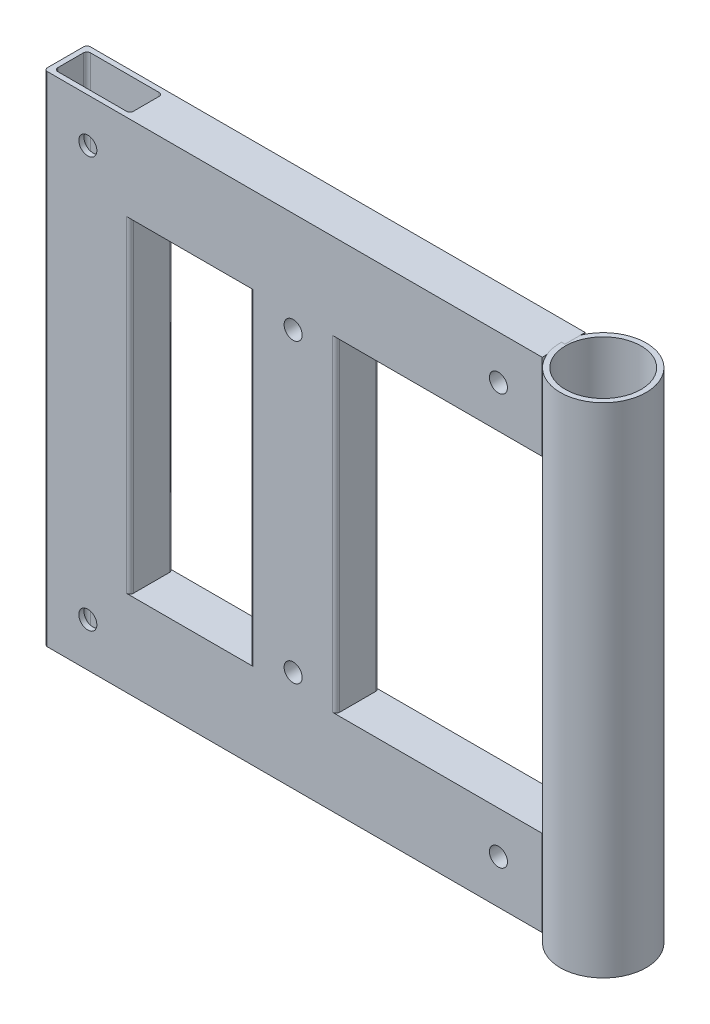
ISO-10303-21;
HEADER;
FILE_DESCRIPTION(('STEP AP214'),'2;1');
FILE_NAME('part.step','',(''),(''),'','','');
FILE_SCHEMA(('AUTOMOTIVE_DESIGN { 1 0 10303 214 1 1 1 1 }'));
ENDSEC;
DATA;
#1=APPLICATION_CONTEXT('core data for automotive mechanical design processes');
#2=APPLICATION_PROTOCOL_DEFINITION('international standard','automotive_design',2000,#1);
#3=PRODUCT_CONTEXT('',#1,'mechanical');
#4=PRODUCT('Part','Part','',(#3));
#5=PRODUCT_RELATED_PRODUCT_CATEGORY('part','',(#4));
#6=PRODUCT_DEFINITION_FORMATION('','',#4);
#7=PRODUCT_DEFINITION_CONTEXT('part definition',#1,'design');
#8=PRODUCT_DEFINITION('design','',#6,#7);
#9=PRODUCT_DEFINITION_SHAPE('','',#8);
#10=(LENGTH_UNIT() NAMED_UNIT(*) SI_UNIT(.MILLI.,.METRE.));
#11=(NAMED_UNIT(*) PLANE_ANGLE_UNIT() SI_UNIT($,.RADIAN.));
#12=(NAMED_UNIT(*) SI_UNIT($,.STERADIAN.) SOLID_ANGLE_UNIT());
#13=UNCERTAINTY_MEASURE_WITH_UNIT(LENGTH_MEASURE(1.E-05),#10,'distance_accuracy_value','');
#14=(GEOMETRIC_REPRESENTATION_CONTEXT(3) GLOBAL_UNCERTAINTY_ASSIGNED_CONTEXT((#13)) GLOBAL_UNIT_ASSIGNED_CONTEXT((#10,
#11,#12)) REPRESENTATION_CONTEXT('',''));
#15=CARTESIAN_POINT('',(0.,0.,0.));
#16=DIRECTION('',(0.,0.,1.));
#17=DIRECTION('',(1.,0.,0.));
#18=AXIS2_PLACEMENT_3D('',#15,#16,#17);
#19=CARTESIAN_POINT('',(313.,-290.,12.5));
#20=DIRECTION('',(0.,1.,0.));
#21=DIRECTION('',(0.,0.,1.));
#22=AXIS2_PLACEMENT_3D('',#19,#20,#21);
#23=CYLINDRICAL_SURFACE('',#22,25.);
#24=CARTESIAN_POINT('',(313.,-290.,12.5));
#25=DIRECTION('',(0.,1.,0.));
#26=DIRECTION('',(0.,0.,1.));
#27=AXIS2_PLACEMENT_3D('',#24,#25,#26);
#28=CIRCLE('',#27,25.);
#29=CARTESIAN_POINT('',(313.,-290.,37.5));
#30=VERTEX_POINT('',#29);
#31=EDGE_CURVE('E11',#30,#30,#28,.T.);
#32=ORIENTED_EDGE('',*,*,#31,.T.);
#33=EDGE_LOOP('',(#32));
#34=FACE_BOUND('',#33,.T.);
#35=CARTESIAN_POINT('',(313.,0.,12.5));
#36=DIRECTION('',(0.,1.,0.));
#37=DIRECTION('',(0.,0.,1.));
#38=AXIS2_PLACEMENT_3D('',#35,#36,#37);
#39=CIRCLE('',#38,25.);
#40=CARTESIAN_POINT('',(313.,0.,37.5));
#41=VERTEX_POINT('',#40);
#42=EDGE_CURVE('E45',#41,#41,#39,.T.);
#43=ORIENTED_EDGE('',*,*,#42,.F.);
#44=EDGE_LOOP('',(#43));
#45=FACE_BOUND('',#44,.T.);
#46=ADVANCED_FACE('F42',(#34,#45),#23,.T.);
#47=CARTESIAN_POINT('',(313.,-290.,12.5));
#48=DIRECTION('',(0.,1.,0.));
#49=DIRECTION('',(0.,0.,1.));
#50=AXIS2_PLACEMENT_3D('',#47,#48,#49);
#51=PLANE('',#50);
#52=CARTESIAN_POINT('',(313.,-290.,12.5));
#53=DIRECTION('',(0.,1.,0.));
#54=DIRECTION('',(0.,0.,1.));
#55=AXIS2_PLACEMENT_3D('',#52,#53,#54);
#56=CIRCLE('',#55,21.9999999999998);
#57=CARTESIAN_POINT('',(313.,-290.,34.4999999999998));
#58=VERTEX_POINT('',#57);
#59=EDGE_CURVE('E55',#58,#58,#56,.T.);
#60=ORIENTED_EDGE('',*,*,#59,.T.);
#61=EDGE_LOOP('',(#60));
#62=FACE_BOUND('',#61,.T.);
#63=ORIENTED_EDGE('',*,*,#31,.F.);
#64=EDGE_LOOP('',(#63));
#65=FACE_BOUND('',#64,.T.);
#66=ADVANCED_FACE('F64',(#62,#65),#51,.F.);
#67=CARTESIAN_POINT('',(313.,0.,12.5));
#68=DIRECTION('',(0.,1.,0.));
#69=DIRECTION('',(0.,0.,1.));
#70=AXIS2_PLACEMENT_3D('',#67,#68,#69);
#71=PLANE('',#70);
#72=CARTESIAN_POINT('',(313.,0.,12.5));
#73=DIRECTION('',(0.,1.,0.));
#74=DIRECTION('',(0.,0.,1.));
#75=AXIS2_PLACEMENT_3D('',#72,#73,#74);
#76=CIRCLE('',#75,21.9999999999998);
#77=CARTESIAN_POINT('',(313.,0.,34.4999999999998));
#78=VERTEX_POINT('',#77);
#79=EDGE_CURVE('E57',#78,#78,#76,.T.);
#80=ORIENTED_EDGE('',*,*,#79,.F.);
#81=EDGE_LOOP('',(#80));
#82=FACE_BOUND('',#81,.T.);
#83=ORIENTED_EDGE('',*,*,#42,.T.);
#84=EDGE_LOOP('',(#83));
#85=FACE_BOUND('',#84,.T.);
#86=ADVANCED_FACE('F70',(#82,#85),#71,.T.);
#87=CARTESIAN_POINT('',(313.,-290.,12.5));
#88=DIRECTION('',(0.,1.,0.));
#89=DIRECTION('',(0.,0.,1.));
#90=AXIS2_PLACEMENT_3D('',#87,#88,#89);
#91=CYLINDRICAL_SURFACE('',#90,21.9999999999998);
#92=ORIENTED_EDGE('',*,*,#59,.F.);
#93=EDGE_LOOP('',(#92));
#94=FACE_BOUND('',#93,.T.);
#95=ORIENTED_EDGE('',*,*,#79,.T.);
#96=EDGE_LOOP('',(#95));
#97=FACE_BOUND('',#96,.T.);
#98=ADVANCED_FACE('F67',(#94,#97),#91,.F.);
#99=CLOSED_SHELL('',(#46,#66,#86,#98));
#100=MANIFOLD_SOLID_BREP('B2',#99);
#101=CARTESIAN_POINT('',(290.,0.,25.));
#102=DIRECTION('',(-1.,0.,0.));
#103=DIRECTION('',(0.,-1.,0.));
#104=AXIS2_PLACEMENT_3D('',#101,#102,#103);
#105=PLANE('',#104);
#106=DIRECTION('',(0.,1.,0.));
#107=VECTOR('',#106,1.);
#108=CARTESIAN_POINT('',(290.,0.,25.));
#109=LINE('',#108,#107);
#110=CARTESIAN_POINT('',(290.,-50.,25.));
#111=VERTEX_POINT('',#110);
#112=CARTESIAN_POINT('',(290.,0.,25.));
#113=VERTEX_POINT('',#112);
#114=EDGE_CURVE('E595',#111,#113,#109,.T.);
#115=ORIENTED_EDGE('',*,*,#114,.F.);
#116=DIRECTION('',(0.,0.,1.));
#117=VECTOR('',#116,1.);
#118=CARTESIAN_POINT('',(290.,-50.,0.));
#119=LINE('',#118,#117);
#120=CARTESIAN_POINT('',(290.,-50.,0.));
#121=VERTEX_POINT('',#120);
#122=EDGE_CURVE('E319',#121,#111,#119,.T.);
#123=ORIENTED_EDGE('',*,*,#122,.F.);
#124=DIRECTION('',(0.,1.,0.));
#125=VECTOR('',#124,1.);
#126=CARTESIAN_POINT('',(290.,0.,0.));
#127=LINE('',#126,#125);
#128=CARTESIAN_POINT('',(290.,0.,0.));
#129=VERTEX_POINT('',#128);
#130=EDGE_CURVE('E327',#121,#129,#127,.T.);
#131=ORIENTED_EDGE('',*,*,#130,.T.);
#132=DIRECTION('',(0.,0.,-1.));
#133=VECTOR('',#132,1.);
#134=CARTESIAN_POINT('',(290.,0.,25.));
#135=LINE('',#134,#133);
#136=EDGE_CURVE('E343',#113,#129,#135,.T.);
#137=ORIENTED_EDGE('',*,*,#136,.F.);
#138=EDGE_LOOP('',(#115,#123,#131,#137));
#139=FACE_BOUND('',#138,.T.);
#140=ADVANCED_FACE('F107',(#139),#105,.F.);
#141=CARTESIAN_POINT('',(25.5,-25.5,25.));
#142=DIRECTION('',(0.,0.,-1.));
#143=DIRECTION('',(-1.,0.,0.));
#144=AXIS2_PLACEMENT_3D('',#141,#142,#143);
#145=CYLINDRICAL_SURFACE('',#144,5.25);
#146=CARTESIAN_POINT('',(25.5,-25.5,22.));
#147=DIRECTION('',(0.,0.,1.));
#148=DIRECTION('',(1.,0.,0.));
#149=AXIS2_PLACEMENT_3D('',#146,#147,#148);
#150=CIRCLE('',#149,5.25);
#151=CARTESIAN_POINT('',(30.75,-25.5,22.));
#152=VERTEX_POINT('',#151);
#153=EDGE_CURVE('E501',#152,#152,#150,.T.);
#154=ORIENTED_EDGE('',*,*,#153,.F.);
#155=EDGE_LOOP('',(#154));
#156=FACE_BOUND('',#155,.T.);
#157=CARTESIAN_POINT('',(25.5,-25.5,25.));
#158=DIRECTION('',(0.,0.,1.));
#159=DIRECTION('',(1.,0.,0.));
#160=AXIS2_PLACEMENT_3D('',#157,#158,#159);
#161=CIRCLE('',#160,5.25);
#162=CARTESIAN_POINT('',(30.75,-25.5,25.));
#163=VERTEX_POINT('',#162);
#164=EDGE_CURVE('E537',#163,#163,#161,.T.);
#165=ORIENTED_EDGE('',*,*,#164,.T.);
#166=EDGE_LOOP('',(#165));
#167=FACE_BOUND('',#166,.T.);
#168=ADVANCED_FACE('F725',(#156,#167),#145,.F.);
#169=CARTESIAN_POINT('',(25.5,-264.5,25.));
#170=DIRECTION('',(0.,0.,-1.));
#171=DIRECTION('',(-1.,0.,0.));
#172=AXIS2_PLACEMENT_3D('',#169,#170,#171);
#173=CYLINDRICAL_SURFACE('',#172,5.25);
#174=CARTESIAN_POINT('',(25.5,-264.5,22.));
#175=DIRECTION('',(0.,0.,1.));
#176=DIRECTION('',(1.,0.,0.));
#177=AXIS2_PLACEMENT_3D('',#174,#175,#176);
#178=CIRCLE('',#177,5.25);
#179=CARTESIAN_POINT('',(30.75,-264.5,22.));
#180=VERTEX_POINT('',#179);
#181=EDGE_CURVE('E111',#180,#180,#178,.T.);
#182=ORIENTED_EDGE('',*,*,#181,.F.);
#183=EDGE_LOOP('',(#182));
#184=FACE_BOUND('',#183,.T.);
#185=CARTESIAN_POINT('',(25.5,-264.5,25.));
#186=DIRECTION('',(0.,0.,1.));
#187=DIRECTION('',(1.,0.,0.));
#188=AXIS2_PLACEMENT_3D('',#185,#186,#187);
#189=CIRCLE('',#188,5.25);
#190=CARTESIAN_POINT('',(30.75,-264.5,25.));
#191=VERTEX_POINT('',#190);
#192=EDGE_CURVE('E521',#191,#191,#189,.T.);
#193=ORIENTED_EDGE('',*,*,#192,.T.);
#194=EDGE_LOOP('',(#193));
#195=FACE_BOUND('',#194,.T.);
#196=ADVANCED_FACE('F731',(#184,#195),#173,.F.);
#197=CARTESIAN_POINT('',(0.,-290.,25.));
#198=DIRECTION('',(0.,0.,1.));
#199=DIRECTION('',(1.,0.,0.));
#200=AXIS2_PLACEMENT_3D('',#197,#198,#199);
#201=PLANE('',#200);
#202=DIRECTION('',(-1.,0.,0.));
#203=VECTOR('',#202,1.);
#204=CARTESIAN_POINT('',(170.,-50.,25.));
#205=LINE('',#204,#203);
#206=CARTESIAN_POINT('',(168.,-50.,25.));
#207=VERTEX_POINT('',#206);
#208=EDGE_CURVE('E553',#111,#207,#205,.T.);
#209=ORIENTED_EDGE('',*,*,#208,.F.);
#210=ORIENTED_EDGE('',*,*,#114,.T.);
#211=DIRECTION('',(-1.,0.,0.));
#212=VECTOR('',#211,1.);
#213=CARTESIAN_POINT('',(0.,0.,25.));
#214=LINE('',#213,#212);
#215=CARTESIAN_POINT('',(2.,0.,25.));
#216=VERTEX_POINT('',#215);
#217=EDGE_CURVE('E344',#113,#216,#214,.T.);
#218=ORIENTED_EDGE('',*,*,#217,.T.);
#219=DIRECTION('',(0.,-1.,0.));
#220=VECTOR('',#219,1.);
#221=CARTESIAN_POINT('',(2.00000000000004,-290.,25.));
#222=LINE('',#221,#220);
#223=CARTESIAN_POINT('',(2.00000000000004,-290.,25.));
#224=VERTEX_POINT('',#223);
#225=EDGE_CURVE('E419',#216,#224,#222,.T.);
#226=ORIENTED_EDGE('',*,*,#225,.T.);
#227=DIRECTION('',(1.,0.,0.));
#228=VECTOR('',#227,1.);
#229=CARTESIAN_POINT('',(0.,-290.,25.));
#230=LINE('',#229,#228);
#231=CARTESIAN_POINT('',(290.,-290.,25.));
#232=VERTEX_POINT('',#231);
#233=EDGE_CURVE('E332',#224,#232,#230,.T.);
#234=ORIENTED_EDGE('',*,*,#233,.T.);
#235=CARTESIAN_POINT('',(290.,-240.,25.));
#236=VERTEX_POINT('',#235);
#237=EDGE_CURVE('E596',#232,#236,#109,.T.);
#238=ORIENTED_EDGE('',*,*,#237,.T.);
#239=DIRECTION('',(1.,0.,0.));
#240=VECTOR('',#239,1.);
#241=CARTESIAN_POINT('',(170.,-240.,25.));
#242=LINE('',#241,#240);
#243=CARTESIAN_POINT('',(168.,-240.,25.));
#244=VERTEX_POINT('',#243);
#245=EDGE_CURVE('E314',#244,#236,#242,.T.);
#246=ORIENTED_EDGE('',*,*,#245,.F.);
#247=DIRECTION('',(0.,-1.,0.));
#248=VECTOR('',#247,1.);
#249=CARTESIAN_POINT('',(168.,-290.,25.));
#250=LINE('',#249,#248);
#251=EDGE_CURVE('E407',#244,#207,#250,.F.);
#252=ORIENTED_EDGE('',*,*,#251,.T.);
#253=EDGE_LOOP('',(#209,#210,#218,#226,#234,#238,#246,#252));
#254=FACE_BOUND('',#253,.T.);
#255=CARTESIAN_POINT('',(145.,-58.6754387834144,25.));
#256=DIRECTION('',(0.,0.,1.));
#257=DIRECTION('',(1.,0.,0.));
#258=AXIS2_PLACEMENT_3D('',#255,#256,#257);
#259=CIRCLE('',#258,5.25);
#260=CARTESIAN_POINT('',(150.25,-58.6754387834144,25.));
#261=VERTEX_POINT('',#260);
#262=EDGE_CURVE('E513',#261,#261,#259,.T.);
#263=ORIENTED_EDGE('',*,*,#262,.F.);
#264=EDGE_LOOP('',(#263));
#265=FACE_BOUND('',#264,.T.);
#266=CARTESIAN_POINT('',(264.5,-264.5,25.));
#267=DIRECTION('',(0.,0.,1.));
#268=DIRECTION('',(1.,0.,0.));
#269=AXIS2_PLACEMENT_3D('',#266,#267,#268);
#270=CIRCLE('',#269,5.25);
#271=CARTESIAN_POINT('',(269.75,-264.5,25.));
#272=VERTEX_POINT('',#271);
#273=EDGE_CURVE('E529',#272,#272,#270,.T.);
#274=ORIENTED_EDGE('',*,*,#273,.F.);
#275=EDGE_LOOP('',(#274));
#276=FACE_BOUND('',#275,.T.);
#277=CARTESIAN_POINT('',(264.5,-25.5,25.));
#278=DIRECTION('',(0.,0.,1.));
#279=DIRECTION('',(1.,0.,0.));
#280=AXIS2_PLACEMENT_3D('',#277,#278,#279);
#281=CIRCLE('',#280,5.25);
#282=CARTESIAN_POINT('',(269.75,-25.5,25.));
#283=VERTEX_POINT('',#282);
#284=EDGE_CURVE('E308',#283,#283,#281,.T.);
#285=ORIENTED_EDGE('',*,*,#284,.F.);
#286=EDGE_LOOP('',(#285));
#287=FACE_BOUND('',#286,.T.);
#288=DIRECTION('',(1.,0.,0.));
#289=VECTOR('',#288,1.);
#290=CARTESIAN_POINT('',(50.,-240.,25.));
#291=LINE('',#290,#289);
#292=CARTESIAN_POINT('',(48.,-240.,25.));
#293=VERTEX_POINT('',#292);
#294=CARTESIAN_POINT('',(122.,-240.,25.));
#295=VERTEX_POINT('',#294);
#296=EDGE_CURVE('E566',#293,#295,#291,.T.);
#297=ORIENTED_EDGE('',*,*,#296,.F.);
#298=DIRECTION('',(0.,-1.,0.));
#299=VECTOR('',#298,1.);
#300=CARTESIAN_POINT('',(48.,-290.,25.));
#301=LINE('',#300,#299);
#302=CARTESIAN_POINT('',(48.,-50.,25.));
#303=VERTEX_POINT('',#302);
#304=EDGE_CURVE('E415',#293,#303,#301,.F.);
#305=ORIENTED_EDGE('',*,*,#304,.T.);
#306=DIRECTION('',(-1.,0.,0.));
#307=VECTOR('',#306,1.);
#308=CARTESIAN_POINT('',(50.,-50.,25.));
#309=LINE('',#308,#307);
#310=CARTESIAN_POINT('',(122.,-50.,25.));
#311=VERTEX_POINT('',#310);
#312=EDGE_CURVE('E569',#311,#303,#309,.T.);
#313=ORIENTED_EDGE('',*,*,#312,.F.);
#314=DIRECTION('',(0.,1.,0.));
#315=VECTOR('',#314,1.);
#316=CARTESIAN_POINT('',(122.,-290.,25.));
#317=LINE('',#316,#315);
#318=EDGE_CURVE('E411',#311,#295,#317,.F.);
#319=ORIENTED_EDGE('',*,*,#318,.T.);
#320=EDGE_LOOP('',(#297,#305,#313,#319));
#321=FACE_BOUND('',#320,.T.);
#322=ORIENTED_EDGE('',*,*,#164,.F.);
#323=EDGE_LOOP('',(#322));
#324=FACE_BOUND('',#323,.T.);
#325=ORIENTED_EDGE('',*,*,#192,.F.);
#326=EDGE_LOOP('',(#325));
#327=FACE_BOUND('',#326,.T.);
#328=CARTESIAN_POINT('',(145.,-231.324561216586,25.));
#329=DIRECTION('',(0.,0.,1.));
#330=DIRECTION('',(1.,0.,0.));
#331=AXIS2_PLACEMENT_3D('',#328,#329,#330);
#332=CIRCLE('',#331,5.25);
#333=CARTESIAN_POINT('',(150.25,-231.324561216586,25.));
#334=VERTEX_POINT('',#333);
#335=EDGE_CURVE('E506',#334,#334,#332,.T.);
#336=ORIENTED_EDGE('',*,*,#335,.F.);
#337=EDGE_LOOP('',(#336));
#338=FACE_BOUND('',#337,.T.);
#339=ADVANCED_FACE('F603',(#254,#265,#276,#287,#321,#324,#327,#338),#201,.T.);
#340=CARTESIAN_POINT('',(0.,-290.,0.));
#341=DIRECTION('',(0.,0.,1.));
#342=DIRECTION('',(1.,0.,0.));
#343=AXIS2_PLACEMENT_3D('',#340,#341,#342);
#344=PLANE('',#343);
#345=CARTESIAN_POINT('',(145.,-58.6754387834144,0.));
#346=DIRECTION('',(0.,0.,1.));
#347=DIRECTION('',(1.,0.,0.));
#348=AXIS2_PLACEMENT_3D('',#345,#346,#347);
#349=CIRCLE('',#348,5.25);
#350=CARTESIAN_POINT('',(150.25,-58.6754387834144,0.));
#351=VERTEX_POINT('',#350);
#352=EDGE_CURVE('E509',#351,#351,#349,.T.);
#353=ORIENTED_EDGE('',*,*,#352,.T.);
#354=EDGE_LOOP('',(#353));
#355=FACE_BOUND('',#354,.T.);
#356=CARTESIAN_POINT('',(264.5,-264.5,0.));
#357=DIRECTION('',(0.,0.,1.));
#358=DIRECTION('',(1.,0.,0.));
#359=AXIS2_PLACEMENT_3D('',#356,#357,#358);
#360=CIRCLE('',#359,5.25);
#361=CARTESIAN_POINT('',(269.75,-264.5,0.));
#362=VERTEX_POINT('',#361);
#363=EDGE_CURVE('E525',#362,#362,#360,.T.);
#364=ORIENTED_EDGE('',*,*,#363,.T.);
#365=EDGE_LOOP('',(#364));
#366=FACE_BOUND('',#365,.T.);
#367=CARTESIAN_POINT('',(264.5,-25.5,0.));
#368=DIRECTION('',(0.,0.,1.));
#369=DIRECTION('',(1.,0.,0.));
#370=AXIS2_PLACEMENT_3D('',#367,#368,#369);
#371=CIRCLE('',#370,5.25);
#372=CARTESIAN_POINT('',(269.75,-25.5,0.));
#373=VERTEX_POINT('',#372);
#374=EDGE_CURVE('E541',#373,#373,#371,.T.);
#375=ORIENTED_EDGE('',*,*,#374,.T.);
#376=EDGE_LOOP('',(#375));
#377=FACE_BOUND('',#376,.T.);
#378=DIRECTION('',(0.,-1.,0.));
#379=VECTOR('',#378,1.);
#380=CARTESIAN_POINT('',(48.,-240.,0.));
#381=LINE('',#380,#379);
#382=CARTESIAN_POINT('',(48.,-50.,0.));
#383=VERTEX_POINT('',#382);
#384=CARTESIAN_POINT('',(48.,-240.,0.));
#385=VERTEX_POINT('',#384);
#386=EDGE_CURVE('E373',#383,#385,#381,.T.);
#387=ORIENTED_EDGE('',*,*,#386,.T.);
#388=DIRECTION('',(1.,0.,0.));
#389=VECTOR('',#388,1.);
#390=CARTESIAN_POINT('',(50.,-240.,0.));
#391=LINE('',#390,#389);
#392=CARTESIAN_POINT('',(122.,-240.,0.));
#393=VERTEX_POINT('',#392);
#394=EDGE_CURVE('E565',#385,#393,#391,.T.);
#395=ORIENTED_EDGE('',*,*,#394,.T.);
#396=DIRECTION('',(0.,1.,0.));
#397=VECTOR('',#396,1.);
#398=CARTESIAN_POINT('',(122.,-50.,0.));
#399=LINE('',#398,#397);
#400=CARTESIAN_POINT('',(122.,-50.,0.));
#401=VERTEX_POINT('',#400);
#402=EDGE_CURVE('E369',#393,#401,#399,.T.);
#403=ORIENTED_EDGE('',*,*,#402,.T.);
#404=DIRECTION('',(-1.,0.,0.));
#405=VECTOR('',#404,1.);
#406=CARTESIAN_POINT('',(50.,-50.,0.));
#407=LINE('',#406,#405);
#408=EDGE_CURVE('E570',#401,#383,#407,.T.);
#409=ORIENTED_EDGE('',*,*,#408,.T.);
#410=EDGE_LOOP('',(#387,#395,#403,#409));
#411=FACE_BOUND('',#410,.T.);
#412=ORIENTED_EDGE('',*,*,#130,.F.);
#413=DIRECTION('',(-1.,0.,0.));
#414=VECTOR('',#413,1.);
#415=CARTESIAN_POINT('',(170.,-50.,0.));
#416=LINE('',#415,#414);
#417=CARTESIAN_POINT('',(168.,-50.,0.));
#418=VERTEX_POINT('',#417);
#419=EDGE_CURVE('E307',#121,#418,#416,.T.);
#420=ORIENTED_EDGE('',*,*,#419,.T.);
#421=DIRECTION('',(0.,-1.,0.));
#422=VECTOR('',#421,1.);
#423=CARTESIAN_POINT('',(168.,-240.,0.));
#424=LINE('',#423,#422);
#425=CARTESIAN_POINT('',(168.,-240.,0.));
#426=VERTEX_POINT('',#425);
#427=EDGE_CURVE('E303',#418,#426,#424,.T.);
#428=ORIENTED_EDGE('',*,*,#427,.T.);
#429=DIRECTION('',(1.,0.,0.));
#430=VECTOR('',#429,1.);
#431=CARTESIAN_POINT('',(170.,-240.,0.));
#432=LINE('',#431,#430);
#433=CARTESIAN_POINT('',(290.,-240.,0.));
#434=VERTEX_POINT('',#433);
#435=EDGE_CURVE('E294',#426,#434,#432,.T.);
#436=ORIENTED_EDGE('',*,*,#435,.T.);
#437=CARTESIAN_POINT('',(290.,-290.,0.));
#438=VERTEX_POINT('',#437);
#439=EDGE_CURVE('E301',#438,#434,#127,.T.);
#440=ORIENTED_EDGE('',*,*,#439,.F.);
#441=DIRECTION('',(1.,0.,0.));
#442=VECTOR('',#441,1.);
#443=CARTESIAN_POINT('',(0.,-290.,0.));
#444=LINE('',#443,#442);
#445=CARTESIAN_POINT('',(2.00000000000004,-290.,0.));
#446=VERTEX_POINT('',#445);
#447=EDGE_CURVE('E335',#446,#438,#444,.T.);
#448=ORIENTED_EDGE('',*,*,#447,.F.);
#449=DIRECTION('',(0.,-1.,0.));
#450=VECTOR('',#449,1.);
#451=CARTESIAN_POINT('',(2.00000000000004,-290.,0.));
#452=LINE('',#451,#450);
#453=CARTESIAN_POINT('',(2.,0.,0.));
#454=VERTEX_POINT('',#453);
#455=EDGE_CURVE('E377',#446,#454,#452,.F.);
#456=ORIENTED_EDGE('',*,*,#455,.T.);
#457=DIRECTION('',(-1.,0.,0.));
#458=VECTOR('',#457,1.);
#459=CARTESIAN_POINT('',(0.,0.,0.));
#460=LINE('',#459,#458);
#461=EDGE_CURVE('E326',#129,#454,#460,.T.);
#462=ORIENTED_EDGE('',*,*,#461,.F.);
#463=EDGE_LOOP('',(#412,#420,#428,#436,#440,#448,#456,#462));
#464=FACE_BOUND('',#463,.T.);
#465=CARTESIAN_POINT('',(25.5,-25.5,0.));
#466=DIRECTION('',(0.,0.,1.));
#467=DIRECTION('',(1.,0.,0.));
#468=AXIS2_PLACEMENT_3D('',#465,#466,#467);
#469=CIRCLE('',#468,5.25);
#470=CARTESIAN_POINT('',(30.75,-25.5,0.));
#471=VERTEX_POINT('',#470);
#472=EDGE_CURVE('E533',#471,#471,#469,.T.);
#473=ORIENTED_EDGE('',*,*,#472,.T.);
#474=EDGE_LOOP('',(#473));
#475=FACE_BOUND('',#474,.T.);
#476=CARTESIAN_POINT('',(25.5,-264.5,0.));
#477=DIRECTION('',(0.,0.,1.));
#478=DIRECTION('',(1.,0.,0.));
#479=AXIS2_PLACEMENT_3D('',#476,#477,#478);
#480=CIRCLE('',#479,5.25);
#481=CARTESIAN_POINT('',(30.75,-264.5,0.));
#482=VERTEX_POINT('',#481);
#483=EDGE_CURVE('E517',#482,#482,#480,.T.);
#484=ORIENTED_EDGE('',*,*,#483,.T.);
#485=EDGE_LOOP('',(#484));
#486=FACE_BOUND('',#485,.T.);
#487=CARTESIAN_POINT('',(145.,-231.324561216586,0.));
#488=DIRECTION('',(0.,0.,1.));
#489=DIRECTION('',(1.,0.,0.));
#490=AXIS2_PLACEMENT_3D('',#487,#488,#489);
#491=CIRCLE('',#490,5.25);
#492=CARTESIAN_POINT('',(150.25,-231.324561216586,0.));
#493=VERTEX_POINT('',#492);
#494=EDGE_CURVE('E505',#493,#493,#491,.T.);
#495=ORIENTED_EDGE('',*,*,#494,.T.);
#496=EDGE_LOOP('',(#495));
#497=FACE_BOUND('',#496,.T.);
#498=ADVANCED_FACE('F297',(#355,#366,#377,#411,#464,#475,#486,#497),#344,.F.);
#499=CARTESIAN_POINT('',(0.,0.,25.));
#500=DIRECTION('',(1.,0.,0.));
#501=DIRECTION('',(0.,1.,0.));
#502=AXIS2_PLACEMENT_3D('',#499,#500,#501);
#503=PLANE('',#502);
#504=DIRECTION('',(0.,0.,-1.));
#505=VECTOR('',#504,1.);
#506=CARTESIAN_POINT('',(0.,0.,25.));
#507=LINE('',#506,#505);
#508=CARTESIAN_POINT('',(0.,0.,23.));
#509=VERTEX_POINT('',#508);
#510=CARTESIAN_POINT('',(0.,0.,2.));
#511=VERTEX_POINT('',#510);
#512=EDGE_CURVE('E339',#509,#511,#507,.T.);
#513=ORIENTED_EDGE('',*,*,#512,.T.);
#514=DIRECTION('',(0.,-1.,0.));
#515=VECTOR('',#514,1.);
#516=CARTESIAN_POINT('',(0.,0.,2.));
#517=LINE('',#516,#515);
#518=CARTESIAN_POINT('',(0.,-290.,2.));
#519=VERTEX_POINT('',#518);
#520=EDGE_CURVE('E357',#511,#519,#517,.T.);
#521=ORIENTED_EDGE('',*,*,#520,.T.);
#522=DIRECTION('',(0.,0.,-1.));
#523=VECTOR('',#522,1.);
#524=CARTESIAN_POINT('',(0.,-290.,25.));
#525=LINE('',#524,#523);
#526=CARTESIAN_POINT('',(0.,-290.,23.));
#527=VERTEX_POINT('',#526);
#528=EDGE_CURVE('E350',#527,#519,#525,.T.);
#529=ORIENTED_EDGE('',*,*,#528,.F.);
#530=DIRECTION('',(0.,-1.,0.));
#531=VECTOR('',#530,1.);
#532=CARTESIAN_POINT('',(0.,0.,23.));
#533=LINE('',#532,#531);
#534=EDGE_CURVE('E354',#527,#509,#533,.F.);
#535=ORIENTED_EDGE('',*,*,#534,.T.);
#536=EDGE_LOOP('',(#513,#521,#529,#535));
#537=FACE_BOUND('',#536,.T.);
#538=ADVANCED_FACE('F617',(#537),#503,.F.);
#539=CARTESIAN_POINT('',(0.,-290.,25.));
#540=DIRECTION('',(0.,1.,0.));
#541=DIRECTION('',(0.,0.,1.));
#542=AXIS2_PLACEMENT_3D('',#539,#540,#541);
#543=PLANE('',#542);
#544=DIRECTION('',(1.,0.,0.));
#545=VECTOR('',#544,1.);
#546=CARTESIAN_POINT('',(5.00000000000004,-290.,22.));
#547=LINE('',#546,#545);
#548=CARTESIAN_POINT('',(5.00000000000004,-290.,22.));
#549=VERTEX_POINT('',#548);
#550=CARTESIAN_POINT('',(45.,-290.,22.));
#551=VERTEX_POINT('',#550);
#552=EDGE_CURVE('E499',#549,#551,#547,.T.);
#553=ORIENTED_EDGE('',*,*,#552,.T.);
#554=CARTESIAN_POINT('',(45.,-290.,20.));
#555=DIRECTION('',(0.,1.,0.));
#556=DIRECTION('',(0.,0.,-1.));
#557=AXIS2_PLACEMENT_3D('',#554,#555,#556);
#558=CIRCLE('',#557,2.);
#559=CARTESIAN_POINT('',(47.,-290.,20.));
#560=VERTEX_POINT('',#559);
#561=EDGE_CURVE('E640',#551,#560,#558,.T.);
#562=ORIENTED_EDGE('',*,*,#561,.T.);
#563=DIRECTION('',(0.,0.,-1.));
#564=VECTOR('',#563,1.);
#565=CARTESIAN_POINT('',(47.,-290.,5.));
#566=LINE('',#565,#564);
#567=CARTESIAN_POINT('',(47.,-290.,5.));
#568=VERTEX_POINT('',#567);
#569=EDGE_CURVE('E644',#560,#568,#566,.T.);
#570=ORIENTED_EDGE('',*,*,#569,.T.);
#571=CARTESIAN_POINT('',(45.,-290.,5.));
#572=DIRECTION('',(0.,1.,0.));
#573=DIRECTION('',(0.,0.,-1.));
#574=AXIS2_PLACEMENT_3D('',#571,#572,#573);
#575=CIRCLE('',#574,2.);
#576=CARTESIAN_POINT('',(45.,-290.,3.));
#577=VERTEX_POINT('',#576);
#578=EDGE_CURVE('E125',#568,#577,#575,.T.);
#579=ORIENTED_EDGE('',*,*,#578,.T.);
#580=DIRECTION('',(-1.,0.,0.));
#581=VECTOR('',#580,1.);
#582=CARTESIAN_POINT('',(5.00000000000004,-290.,3.));
#583=LINE('',#582,#581);
#584=CARTESIAN_POINT('',(5.00000000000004,-290.,3.));
#585=VERTEX_POINT('',#584);
#586=EDGE_CURVE('E650',#577,#585,#583,.T.);
#587=ORIENTED_EDGE('',*,*,#586,.T.);
#588=CARTESIAN_POINT('',(5.00000000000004,-290.,5.));
#589=DIRECTION('',(0.,1.,0.));
#590=DIRECTION('',(0.,0.,-1.));
#591=AXIS2_PLACEMENT_3D('',#588,#589,#590);
#592=CIRCLE('',#591,2.);
#593=CARTESIAN_POINT('',(3.00000000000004,-290.,5.));
#594=VERTEX_POINT('',#593);
#595=EDGE_CURVE('E630',#585,#594,#592,.T.);
#596=ORIENTED_EDGE('',*,*,#595,.T.);
#597=DIRECTION('',(0.,0.,1.));
#598=VECTOR('',#597,1.);
#599=CARTESIAN_POINT('',(3.00000000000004,-290.,5.));
#600=LINE('',#599,#598);
#601=CARTESIAN_POINT('',(3.00000000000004,-290.,20.));
#602=VERTEX_POINT('',#601);
#603=EDGE_CURVE('E627',#594,#602,#600,.T.);
#604=ORIENTED_EDGE('',*,*,#603,.T.);
#605=CARTESIAN_POINT('',(5.00000000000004,-290.,20.));
#606=DIRECTION('',(0.,1.,0.));
#607=DIRECTION('',(0.,0.,1.));
#608=AXIS2_PLACEMENT_3D('',#605,#606,#607);
#609=CIRCLE('',#608,2.);
#610=EDGE_CURVE('E629',#602,#549,#609,.T.);
#611=ORIENTED_EDGE('',*,*,#610,.T.);
#612=EDGE_LOOP('',(#553,#562,#570,#579,#587,#596,#604,#611));
#613=FACE_BOUND('',#612,.T.);
#614=ORIENTED_EDGE('',*,*,#528,.T.);
#615=CARTESIAN_POINT('',(2.00000000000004,-290.,2.));
#616=DIRECTION('',(0.,1.,0.));
#617=DIRECTION('',(0.,0.,1.));
#618=AXIS2_PLACEMENT_3D('',#615,#616,#617);
#619=CIRCLE('',#618,2.);
#620=EDGE_CURVE('E364',#519,#446,#619,.F.);
#621=ORIENTED_EDGE('',*,*,#620,.T.);
#622=ORIENTED_EDGE('',*,*,#447,.T.);
#623=DIRECTION('',(0.,0.,-1.));
#624=VECTOR('',#623,1.);
#625=CARTESIAN_POINT('',(290.,-290.,25.));
#626=LINE('',#625,#624);
#627=EDGE_CURVE('E324',#232,#438,#626,.T.);
#628=ORIENTED_EDGE('',*,*,#627,.F.);
#629=ORIENTED_EDGE('',*,*,#233,.F.);
#630=CARTESIAN_POINT('',(2.00000000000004,-290.,23.));
#631=DIRECTION('',(0.,1.,0.));
#632=DIRECTION('',(0.,0.,1.));
#633=AXIS2_PLACEMENT_3D('',#630,#631,#632);
#634=CIRCLE('',#633,2.);
#635=EDGE_CURVE('E361',#224,#527,#634,.F.);
#636=ORIENTED_EDGE('',*,*,#635,.T.);
#637=EDGE_LOOP('',(#614,#621,#622,#628,#629,#636));
#638=FACE_BOUND('',#637,.T.);
#639=ADVANCED_FACE('F615',(#613,#638),#543,.F.);
#640=ORIENTED_EDGE('',*,*,#439,.T.);
#641=DIRECTION('',(0.,0.,1.));
#642=VECTOR('',#641,1.);
#643=CARTESIAN_POINT('',(290.,-240.,0.));
#644=LINE('',#643,#642);
#645=EDGE_CURVE('E311',#434,#236,#644,.T.);
#646=ORIENTED_EDGE('',*,*,#645,.T.);
#647=ORIENTED_EDGE('',*,*,#237,.F.);
#648=ORIENTED_EDGE('',*,*,#627,.T.);
#649=EDGE_LOOP('',(#640,#646,#647,#648));
#650=FACE_BOUND('',#649,.T.);
#651=ADVANCED_FACE('F322',(#650),#105,.F.);
#652=CARTESIAN_POINT('',(0.,0.,25.));
#653=DIRECTION('',(0.,-1.,0.));
#654=DIRECTION('',(0.,0.,-1.));
#655=AXIS2_PLACEMENT_3D('',#652,#653,#654);
#656=PLANE('',#655);
#657=DIRECTION('',(0.,0.,-1.));
#658=VECTOR('',#657,1.);
#659=CARTESIAN_POINT('',(47.,0.,5.));
#660=LINE('',#659,#658);
#661=CARTESIAN_POINT('',(47.,0.,20.));
#662=VERTEX_POINT('',#661);
#663=CARTESIAN_POINT('',(47.,0.,5.));
#664=VERTEX_POINT('',#663);
#665=EDGE_CURVE('E637',#662,#664,#660,.T.);
#666=ORIENTED_EDGE('',*,*,#665,.F.);
#667=CARTESIAN_POINT('',(45.,0.,20.));
#668=DIRECTION('',(0.,1.,0.));
#669=DIRECTION('',(0.,0.,-1.));
#670=AXIS2_PLACEMENT_3D('',#667,#668,#669);
#671=CIRCLE('',#670,2.);
#672=CARTESIAN_POINT('',(45.,0.,22.));
#673=VERTEX_POINT('',#672);
#674=EDGE_CURVE('E133',#673,#662,#671,.T.);
#675=ORIENTED_EDGE('',*,*,#674,.F.);
#676=DIRECTION('',(1.,0.,0.));
#677=VECTOR('',#676,1.);
#678=CARTESIAN_POINT('',(5.00000000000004,0.,22.));
#679=LINE('',#678,#677);
#680=CARTESIAN_POINT('',(5.00000000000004,0.,22.));
#681=VERTEX_POINT('',#680);
#682=EDGE_CURVE('E481',#681,#673,#679,.T.);
#683=ORIENTED_EDGE('',*,*,#682,.F.);
#684=CARTESIAN_POINT('',(5.00000000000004,0.,20.));
#685=DIRECTION('',(0.,1.,0.));
#686=DIRECTION('',(0.,0.,1.));
#687=AXIS2_PLACEMENT_3D('',#684,#685,#686);
#688=CIRCLE('',#687,2.);
#689=CARTESIAN_POINT('',(3.00000000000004,0.,20.));
#690=VERTEX_POINT('',#689);
#691=EDGE_CURVE('E681',#690,#681,#688,.T.);
#692=ORIENTED_EDGE('',*,*,#691,.F.);
#693=DIRECTION('',(0.,0.,1.));
#694=VECTOR('',#693,1.);
#695=CARTESIAN_POINT('',(3.00000000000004,0.,5.));
#696=LINE('',#695,#694);
#697=CARTESIAN_POINT('',(3.00000000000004,0.,5.));
#698=VERTEX_POINT('',#697);
#699=EDGE_CURVE('E678',#698,#690,#696,.T.);
#700=ORIENTED_EDGE('',*,*,#699,.F.);
#701=CARTESIAN_POINT('',(5.00000000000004,0.,5.));
#702=DIRECTION('',(0.,1.,0.));
#703=DIRECTION('',(0.,0.,-1.));
#704=AXIS2_PLACEMENT_3D('',#701,#702,#703);
#705=CIRCLE('',#704,2.);
#706=CARTESIAN_POINT('',(5.00000000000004,0.,3.));
#707=VERTEX_POINT('',#706);
#708=EDGE_CURVE('E674',#707,#698,#705,.T.);
#709=ORIENTED_EDGE('',*,*,#708,.F.);
#710=DIRECTION('',(-1.,0.,0.));
#711=VECTOR('',#710,1.);
#712=CARTESIAN_POINT('',(5.00000000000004,0.,3.));
#713=LINE('',#712,#711);
#714=CARTESIAN_POINT('',(45.,0.,3.));
#715=VERTEX_POINT('',#714);
#716=EDGE_CURVE('E670',#715,#707,#713,.T.);
#717=ORIENTED_EDGE('',*,*,#716,.F.);
#718=CARTESIAN_POINT('',(45.,0.,5.));
#719=DIRECTION('',(0.,1.,0.));
#720=DIRECTION('',(0.,0.,-1.));
#721=AXIS2_PLACEMENT_3D('',#718,#719,#720);
#722=CIRCLE('',#721,2.);
#723=EDGE_CURVE('E666',#664,#715,#722,.T.);
#724=ORIENTED_EDGE('',*,*,#723,.F.);
#725=EDGE_LOOP('',(#666,#675,#683,#692,#700,#709,#717,#724));
#726=FACE_BOUND('',#725,.T.);
#727=ORIENTED_EDGE('',*,*,#461,.T.);
#728=CARTESIAN_POINT('',(2.,0.,2.));
#729=DIRECTION('',(0.,-1.,0.));
#730=DIRECTION('',(0.,0.,-1.));
#731=AXIS2_PLACEMENT_3D('',#728,#729,#730);
#732=CIRCLE('',#731,2.);
#733=EDGE_CURVE('E383',#454,#511,#732,.F.);
#734=ORIENTED_EDGE('',*,*,#733,.T.);
#735=ORIENTED_EDGE('',*,*,#512,.F.);
#736=CARTESIAN_POINT('',(2.,0.,23.));
#737=DIRECTION('',(0.,-1.,0.));
#738=DIRECTION('',(0.,0.,-1.));
#739=AXIS2_PLACEMENT_3D('',#736,#737,#738);
#740=CIRCLE('',#739,2.);
#741=EDGE_CURVE('E380',#509,#216,#740,.F.);
#742=ORIENTED_EDGE('',*,*,#741,.T.);
#743=ORIENTED_EDGE('',*,*,#217,.F.);
#744=ORIENTED_EDGE('',*,*,#136,.T.);
#745=EDGE_LOOP('',(#727,#734,#735,#742,#743,#744));
#746=FACE_BOUND('',#745,.T.);
#747=ADVANCED_FACE('F693',(#726,#746),#656,.F.);
#748=CARTESIAN_POINT('',(50.,-50.,25.));
#749=DIRECTION('',(1.,0.,0.));
#750=DIRECTION('',(0.,1.,0.));
#751=AXIS2_PLACEMENT_3D('',#748,#749,#750);
#752=PLANE('',#751);
#753=DIRECTION('',(0.,0.,-1.));
#754=VECTOR('',#753,1.);
#755=CARTESIAN_POINT('',(50.,-240.,25.));
#756=LINE('',#755,#754);
#757=CARTESIAN_POINT('',(50.,-240.,23.));
#758=VERTEX_POINT('',#757);
#759=CARTESIAN_POINT('',(50.,-240.,2.));
#760=VERTEX_POINT('',#759);
#761=EDGE_CURVE('E589',#758,#760,#756,.T.);
#762=ORIENTED_EDGE('',*,*,#761,.T.);
#763=DIRECTION('',(0.,-1.,0.));
#764=VECTOR('',#763,1.);
#765=CARTESIAN_POINT('',(50.,-50.,2.));
#766=LINE('',#765,#764);
#767=CARTESIAN_POINT('',(50.,-50.,2.));
#768=VERTEX_POINT('',#767);
#769=EDGE_CURVE('E390',#760,#768,#766,.F.);
#770=ORIENTED_EDGE('',*,*,#769,.T.);
#771=DIRECTION('',(0.,0.,-1.));
#772=VECTOR('',#771,1.);
#773=CARTESIAN_POINT('',(50.,-50.,25.));
#774=LINE('',#773,#772);
#775=CARTESIAN_POINT('',(50.,-50.,23.));
#776=VERTEX_POINT('',#775);
#777=EDGE_CURVE('E573',#776,#768,#774,.T.);
#778=ORIENTED_EDGE('',*,*,#777,.F.);
#779=DIRECTION('',(0.,-1.,0.));
#780=VECTOR('',#779,1.);
#781=CARTESIAN_POINT('',(50.,-50.,23.));
#782=LINE('',#781,#780);
#783=EDGE_CURVE('E386',#776,#758,#782,.T.);
#784=ORIENTED_EDGE('',*,*,#783,.T.);
#785=EDGE_LOOP('',(#762,#770,#778,#784));
#786=FACE_BOUND('',#785,.T.);
#787=ADVANCED_FACE('F742',(#786),#752,.T.);
#788=CARTESIAN_POINT('',(50.,-240.,25.));
#789=DIRECTION('',(0.,1.,0.));
#790=DIRECTION('',(0.,0.,1.));
#791=AXIS2_PLACEMENT_3D('',#788,#789,#790);
#792=PLANE('',#791);
#793=ORIENTED_EDGE('',*,*,#394,.F.);
#794=CARTESIAN_POINT('',(48.,-240.,2.));
#795=DIRECTION('',(0.,1.,0.));
#796=DIRECTION('',(0.,0.,1.));
#797=AXIS2_PLACEMENT_3D('',#794,#795,#796);
#798=CIRCLE('',#797,2.);
#799=EDGE_CURVE('E423',#385,#760,#798,.F.);
#800=ORIENTED_EDGE('',*,*,#799,.T.);
#801=ORIENTED_EDGE('',*,*,#761,.F.);
#802=CARTESIAN_POINT('',(48.,-240.,23.));
#803=DIRECTION('',(0.,1.,0.));
#804=DIRECTION('',(0.,0.,1.));
#805=AXIS2_PLACEMENT_3D('',#802,#803,#804);
#806=CIRCLE('',#805,2.);
#807=EDGE_CURVE('E444',#758,#293,#806,.F.);
#808=ORIENTED_EDGE('',*,*,#807,.T.);
#809=ORIENTED_EDGE('',*,*,#296,.T.);
#810=CARTESIAN_POINT('',(122.,-240.,23.));
#811=DIRECTION('',(0.,1.,0.));
#812=DIRECTION('',(0.,0.,1.));
#813=AXIS2_PLACEMENT_3D('',#810,#811,#812);
#814=CIRCLE('',#813,2.);
#815=CARTESIAN_POINT('',(120.,-240.,23.));
#816=VERTEX_POINT('',#815);
#817=EDGE_CURVE('E455',#295,#816,#814,.F.);
#818=ORIENTED_EDGE('',*,*,#817,.T.);
#819=DIRECTION('',(0.,0.,-1.));
#820=VECTOR('',#819,1.);
#821=CARTESIAN_POINT('',(120.,-240.,25.));
#822=LINE('',#821,#820);
#823=CARTESIAN_POINT('',(120.,-240.,2.));
#824=VERTEX_POINT('',#823);
#825=EDGE_CURVE('E585',#816,#824,#822,.T.);
#826=ORIENTED_EDGE('',*,*,#825,.T.);
#827=CARTESIAN_POINT('',(122.,-240.,2.));
#828=DIRECTION('',(0.,1.,0.));
#829=DIRECTION('',(0.,0.,1.));
#830=AXIS2_PLACEMENT_3D('',#827,#828,#829);
#831=CIRCLE('',#830,2.);
#832=EDGE_CURVE('E433',#824,#393,#831,.F.);
#833=ORIENTED_EDGE('',*,*,#832,.T.);
#834=EDGE_LOOP('',(#793,#800,#801,#808,#809,#818,#826,#833));
#835=FACE_BOUND('',#834,.T.);
#836=ADVANCED_FACE('F780',(#835),#792,.T.);
#837=CARTESIAN_POINT('',(120.,-50.,25.));
#838=DIRECTION('',(-1.,0.,0.));
#839=DIRECTION('',(0.,-1.,0.));
#840=AXIS2_PLACEMENT_3D('',#837,#838,#839);
#841=PLANE('',#840);
#842=DIRECTION('',(0.,0.,-1.));
#843=VECTOR('',#842,1.);
#844=CARTESIAN_POINT('',(120.,-50.,25.));
#845=LINE('',#844,#843);
#846=CARTESIAN_POINT('',(120.,-50.,23.));
#847=VERTEX_POINT('',#846);
#848=CARTESIAN_POINT('',(120.,-50.,2.));
#849=VERTEX_POINT('',#848);
#850=EDGE_CURVE('E581',#847,#849,#845,.T.);
#851=ORIENTED_EDGE('',*,*,#850,.T.);
#852=DIRECTION('',(0.,1.,0.));
#853=VECTOR('',#852,1.);
#854=CARTESIAN_POINT('',(120.,-240.,2.));
#855=LINE('',#854,#853);
#856=EDGE_CURVE('E397',#849,#824,#855,.F.);
#857=ORIENTED_EDGE('',*,*,#856,.T.);
#858=ORIENTED_EDGE('',*,*,#825,.F.);
#859=DIRECTION('',(0.,1.,0.));
#860=VECTOR('',#859,1.);
#861=CARTESIAN_POINT('',(120.,-50.,23.));
#862=LINE('',#861,#860);
#863=EDGE_CURVE('E393',#816,#847,#862,.T.);
#864=ORIENTED_EDGE('',*,*,#863,.T.);
#865=EDGE_LOOP('',(#851,#857,#858,#864));
#866=FACE_BOUND('',#865,.T.);
#867=ADVANCED_FACE('F783',(#866),#841,.T.);
#868=CARTESIAN_POINT('',(50.,-50.,25.));
#869=DIRECTION('',(0.,-1.,0.));
#870=DIRECTION('',(0.,0.,-1.));
#871=AXIS2_PLACEMENT_3D('',#868,#869,#870);
#872=PLANE('',#871);
#873=ORIENTED_EDGE('',*,*,#408,.F.);
#874=CARTESIAN_POINT('',(122.,-50.,2.));
#875=DIRECTION('',(0.,-1.,0.));
#876=DIRECTION('',(0.,0.,-1.));
#877=AXIS2_PLACEMENT_3D('',#874,#875,#876);
#878=CIRCLE('',#877,2.);
#879=EDGE_CURVE('E430',#401,#849,#878,.F.);
#880=ORIENTED_EDGE('',*,*,#879,.T.);
#881=ORIENTED_EDGE('',*,*,#850,.F.);
#882=CARTESIAN_POINT('',(122.,-50.,23.));
#883=DIRECTION('',(0.,-1.,0.));
#884=DIRECTION('',(0.,0.,-1.));
#885=AXIS2_PLACEMENT_3D('',#882,#883,#884);
#886=CIRCLE('',#885,2.);
#887=EDGE_CURVE('E451',#847,#311,#886,.F.);
#888=ORIENTED_EDGE('',*,*,#887,.T.);
#889=ORIENTED_EDGE('',*,*,#312,.T.);
#890=CARTESIAN_POINT('',(48.,-50.,23.));
#891=DIRECTION('',(0.,-1.,0.));
#892=DIRECTION('',(0.,0.,-1.));
#893=AXIS2_PLACEMENT_3D('',#890,#891,#892);
#894=CIRCLE('',#893,2.);
#895=EDGE_CURVE('E448',#303,#776,#894,.F.);
#896=ORIENTED_EDGE('',*,*,#895,.T.);
#897=ORIENTED_EDGE('',*,*,#777,.T.);
#898=CARTESIAN_POINT('',(48.,-50.,2.));
#899=DIRECTION('',(0.,-1.,0.));
#900=DIRECTION('',(0.,0.,-1.));
#901=AXIS2_PLACEMENT_3D('',#898,#899,#900);
#902=CIRCLE('',#901,2.);
#903=EDGE_CURVE('E426',#768,#383,#902,.F.);
#904=ORIENTED_EDGE('',*,*,#903,.T.);
#905=EDGE_LOOP('',(#873,#880,#881,#888,#889,#896,#897,#904));
#906=FACE_BOUND('',#905,.T.);
#907=ADVANCED_FACE('F795',(#906),#872,.T.);
#908=CARTESIAN_POINT('',(170.,-240.,25.));
#909=DIRECTION('',(0.,1.,0.));
#910=DIRECTION('',(0.,0.,1.));
#911=AXIS2_PLACEMENT_3D('',#908,#909,#910);
#912=PLANE('',#911);
#913=ORIENTED_EDGE('',*,*,#245,.T.);
#914=ORIENTED_EDGE('',*,*,#645,.F.);
#915=ORIENTED_EDGE('',*,*,#435,.F.);
#916=CARTESIAN_POINT('',(168.,-240.,2.));
#917=DIRECTION('',(0.,1.,0.));
#918=DIRECTION('',(0.,0.,1.));
#919=AXIS2_PLACEMENT_3D('',#916,#917,#918);
#920=CIRCLE('',#919,2.);
#921=CARTESIAN_POINT('',(170.,-240.,2.));
#922=VERTEX_POINT('',#921);
#923=EDGE_CURVE('E437',#426,#922,#920,.F.);
#924=ORIENTED_EDGE('',*,*,#923,.T.);
#925=DIRECTION('',(0.,0.,-1.));
#926=VECTOR('',#925,1.);
#927=CARTESIAN_POINT('',(170.,-240.,25.));
#928=LINE('',#927,#926);
#929=CARTESIAN_POINT('',(170.,-240.,23.));
#930=VERTEX_POINT('',#929);
#931=EDGE_CURVE('E555',#930,#922,#928,.T.);
#932=ORIENTED_EDGE('',*,*,#931,.F.);
#933=CARTESIAN_POINT('',(168.,-240.,23.));
#934=DIRECTION('',(0.,1.,0.));
#935=DIRECTION('',(0.,0.,1.));
#936=AXIS2_PLACEMENT_3D('',#933,#934,#935);
#937=CIRCLE('',#936,2.);
#938=EDGE_CURVE('E117',#930,#244,#937,.F.);
#939=ORIENTED_EDGE('',*,*,#938,.T.);
#940=EDGE_LOOP('',(#913,#914,#915,#924,#932,#939));
#941=FACE_BOUND('',#940,.T.);
#942=ADVANCED_FACE('F312',(#941),#912,.T.);
#943=CARTESIAN_POINT('',(170.,-50.,25.));
#944=DIRECTION('',(0.,-1.,0.));
#945=DIRECTION('',(0.,0.,-1.));
#946=AXIS2_PLACEMENT_3D('',#943,#944,#945);
#947=PLANE('',#946);
#948=ORIENTED_EDGE('',*,*,#419,.F.);
#949=ORIENTED_EDGE('',*,*,#122,.T.);
#950=ORIENTED_EDGE('',*,*,#208,.T.);
#951=CARTESIAN_POINT('',(168.,-50.,23.));
#952=DIRECTION('',(0.,-1.,0.));
#953=DIRECTION('',(0.,0.,-1.));
#954=AXIS2_PLACEMENT_3D('',#951,#952,#953);
#955=CIRCLE('',#954,2.);
#956=CARTESIAN_POINT('',(170.,-50.,23.));
#957=VERTEX_POINT('',#956);
#958=EDGE_CURVE('E40',#207,#957,#955,.F.);
#959=ORIENTED_EDGE('',*,*,#958,.T.);
#960=DIRECTION('',(0.,0.,-1.));
#961=VECTOR('',#960,1.);
#962=CARTESIAN_POINT('',(170.,-50.,25.));
#963=LINE('',#962,#961);
#964=CARTESIAN_POINT('',(170.,-50.,2.));
#965=VERTEX_POINT('',#964);
#966=EDGE_CURVE('E562',#957,#965,#963,.T.);
#967=ORIENTED_EDGE('',*,*,#966,.T.);
#968=CARTESIAN_POINT('',(168.,-50.,2.));
#969=DIRECTION('',(0.,-1.,0.));
#970=DIRECTION('',(0.,0.,-1.));
#971=AXIS2_PLACEMENT_3D('',#968,#969,#970);
#972=CIRCLE('',#971,2.);
#973=EDGE_CURVE('E440',#965,#418,#972,.F.);
#974=ORIENTED_EDGE('',*,*,#973,.T.);
#975=EDGE_LOOP('',(#948,#949,#950,#959,#967,#974));
#976=FACE_BOUND('',#975,.T.);
#977=ADVANCED_FACE('F834',(#976),#947,.T.);
#978=CARTESIAN_POINT('',(170.,-50.,25.));
#979=DIRECTION('',(1.,0.,0.));
#980=DIRECTION('',(0.,1.,0.));
#981=AXIS2_PLACEMENT_3D('',#978,#979,#980);
#982=PLANE('',#981);
#983=ORIENTED_EDGE('',*,*,#931,.T.);
#984=DIRECTION('',(0.,-1.,0.));
#985=VECTOR('',#984,1.);
#986=CARTESIAN_POINT('',(170.,-50.,2.));
#987=LINE('',#986,#985);
#988=EDGE_CURVE('E404',#922,#965,#987,.F.);
#989=ORIENTED_EDGE('',*,*,#988,.T.);
#990=ORIENTED_EDGE('',*,*,#966,.F.);
#991=DIRECTION('',(0.,-1.,0.));
#992=VECTOR('',#991,1.);
#993=CARTESIAN_POINT('',(170.,-50.,23.));
#994=LINE('',#993,#992);
#995=EDGE_CURVE('E400',#957,#930,#994,.T.);
#996=ORIENTED_EDGE('',*,*,#995,.T.);
#997=EDGE_LOOP('',(#983,#989,#990,#996));
#998=FACE_BOUND('',#997,.T.);
#999=ADVANCED_FACE('F837',(#998),#982,.T.);
#1000=CARTESIAN_POINT('',(264.5,-25.5,25.));
#1001=DIRECTION('',(0.,0.,-1.));
#1002=DIRECTION('',(-1.,0.,0.));
#1003=AXIS2_PLACEMENT_3D('',#1000,#1001,#1002);
#1004=CYLINDRICAL_SURFACE('',#1003,5.25);
#1005=ORIENTED_EDGE('',*,*,#284,.T.);
#1006=EDGE_LOOP('',(#1005));
#1007=FACE_BOUND('',#1006,.T.);
#1008=ORIENTED_EDGE('',*,*,#374,.F.);
#1009=EDGE_LOOP('',(#1008));
#1010=FACE_BOUND('',#1009,.T.);
#1011=ADVANCED_FACE('F840',(#1007,#1010),#1004,.F.);
#1012=CARTESIAN_POINT('',(25.5,-25.5,3.));
#1013=DIRECTION('',(0.,0.,-1.));
#1014=DIRECTION('',(-1.,0.,0.));
#1015=AXIS2_PLACEMENT_3D('',#1012,#1013,#1014);
#1016=CIRCLE('',#1015,5.25);
#1017=CARTESIAN_POINT('',(20.25,-25.5,3.));
#1018=VERTEX_POINT('',#1017);
#1019=EDGE_CURVE('E462',#1018,#1018,#1016,.T.);
#1020=ORIENTED_EDGE('',*,*,#1019,.F.);
#1021=EDGE_LOOP('',(#1020));
#1022=FACE_BOUND('',#1021,.T.);
#1023=ORIENTED_EDGE('',*,*,#472,.F.);
#1024=EDGE_LOOP('',(#1023));
#1025=FACE_BOUND('',#1024,.T.);
#1026=ADVANCED_FACE('F734',(#1022,#1025),#145,.F.);
#1027=CARTESIAN_POINT('',(264.5,-264.5,25.));
#1028=DIRECTION('',(0.,0.,-1.));
#1029=DIRECTION('',(-1.,0.,0.));
#1030=AXIS2_PLACEMENT_3D('',#1027,#1028,#1029);
#1031=CYLINDRICAL_SURFACE('',#1030,5.25);
#1032=ORIENTED_EDGE('',*,*,#273,.T.);
#1033=EDGE_LOOP('',(#1032));
#1034=FACE_BOUND('',#1033,.T.);
#1035=ORIENTED_EDGE('',*,*,#363,.F.);
#1036=EDGE_LOOP('',(#1035));
#1037=FACE_BOUND('',#1036,.T.);
#1038=ADVANCED_FACE('F846',(#1034,#1037),#1031,.F.);
#1039=CARTESIAN_POINT('',(25.5,-264.5,3.));
#1040=DIRECTION('',(0.,0.,-1.));
#1041=DIRECTION('',(-1.,0.,0.));
#1042=AXIS2_PLACEMENT_3D('',#1039,#1040,#1041);
#1043=CIRCLE('',#1042,5.25);
#1044=CARTESIAN_POINT('',(20.25,-264.5,3.));
#1045=VERTEX_POINT('',#1044);
#1046=EDGE_CURVE('E459',#1045,#1045,#1043,.T.);
#1047=ORIENTED_EDGE('',*,*,#1046,.F.);
#1048=EDGE_LOOP('',(#1047));
#1049=FACE_BOUND('',#1048,.T.);
#1050=ORIENTED_EDGE('',*,*,#483,.F.);
#1051=EDGE_LOOP('',(#1050));
#1052=FACE_BOUND('',#1051,.T.);
#1053=ADVANCED_FACE('F850',(#1049,#1052),#173,.F.);
#1054=CARTESIAN_POINT('',(145.,-58.6754387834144,25.));
#1055=DIRECTION('',(0.,0.,-1.));
#1056=DIRECTION('',(-1.,0.,0.));
#1057=AXIS2_PLACEMENT_3D('',#1054,#1055,#1056);
#1058=CYLINDRICAL_SURFACE('',#1057,5.25);
#1059=ORIENTED_EDGE('',*,*,#262,.T.);
#1060=EDGE_LOOP('',(#1059));
#1061=FACE_BOUND('',#1060,.T.);
#1062=ORIENTED_EDGE('',*,*,#352,.F.);
#1063=EDGE_LOOP('',(#1062));
#1064=FACE_BOUND('',#1063,.T.);
#1065=ADVANCED_FACE('F813',(#1061,#1064),#1058,.F.);
#1066=CARTESIAN_POINT('',(145.,-231.324561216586,25.));
#1067=DIRECTION('',(0.,0.,-1.));
#1068=DIRECTION('',(-1.,0.,0.));
#1069=AXIS2_PLACEMENT_3D('',#1066,#1067,#1068);
#1070=CYLINDRICAL_SURFACE('',#1069,5.25);
#1071=ORIENTED_EDGE('',*,*,#335,.T.);
#1072=EDGE_LOOP('',(#1071));
#1073=FACE_BOUND('',#1072,.T.);
#1074=ORIENTED_EDGE('',*,*,#494,.F.);
#1075=EDGE_LOOP('',(#1074));
#1076=FACE_BOUND('',#1075,.T.);
#1077=ADVANCED_FACE('F751',(#1073,#1076),#1070,.F.);
#1078=CARTESIAN_POINT('',(2.,0.,2.));
#1079=DIRECTION('',(0.,-1.,0.));
#1080=DIRECTION('',(1.,0.,0.));
#1081=AXIS2_PLACEMENT_3D('',#1078,#1079,#1080);
#1082=CYLINDRICAL_SURFACE('',#1081,2.);
#1083=ORIENTED_EDGE('',*,*,#733,.F.);
#1084=ORIENTED_EDGE('',*,*,#455,.F.);
#1085=ORIENTED_EDGE('',*,*,#620,.F.);
#1086=ORIENTED_EDGE('',*,*,#520,.F.);
#1087=EDGE_LOOP('',(#1083,#1084,#1085,#1086));
#1088=FACE_BOUND('',#1087,.T.);
#1089=ADVANCED_FACE('F622',(#1088),#1082,.T.);
#1090=CARTESIAN_POINT('',(48.,-290.,2.));
#1091=DIRECTION('',(0.,1.,0.));
#1092=DIRECTION('',(-1.,0.,0.));
#1093=AXIS2_PLACEMENT_3D('',#1090,#1091,#1092);
#1094=CYLINDRICAL_SURFACE('',#1093,2.);
#1095=ORIENTED_EDGE('',*,*,#903,.F.);
#1096=ORIENTED_EDGE('',*,*,#769,.F.);
#1097=ORIENTED_EDGE('',*,*,#799,.F.);
#1098=ORIENTED_EDGE('',*,*,#386,.F.);
#1099=EDGE_LOOP('',(#1095,#1096,#1097,#1098));
#1100=FACE_BOUND('',#1099,.T.);
#1101=ADVANCED_FACE('F750',(#1100),#1094,.T.);
#1102=CARTESIAN_POINT('',(122.,-290.,2.));
#1103=DIRECTION('',(0.,-1.,0.));
#1104=DIRECTION('',(1.,0.,0.));
#1105=AXIS2_PLACEMENT_3D('',#1102,#1103,#1104);
#1106=CYLINDRICAL_SURFACE('',#1105,2.);
#1107=ORIENTED_EDGE('',*,*,#832,.F.);
#1108=ORIENTED_EDGE('',*,*,#856,.F.);
#1109=ORIENTED_EDGE('',*,*,#879,.F.);
#1110=ORIENTED_EDGE('',*,*,#402,.F.);
#1111=EDGE_LOOP('',(#1107,#1108,#1109,#1110));
#1112=FACE_BOUND('',#1111,.T.);
#1113=ADVANCED_FACE('F754',(#1112),#1106,.T.);
#1114=CARTESIAN_POINT('',(168.,-290.,2.));
#1115=DIRECTION('',(0.,1.,0.));
#1116=DIRECTION('',(-1.,0.,0.));
#1117=AXIS2_PLACEMENT_3D('',#1114,#1115,#1116);
#1118=CYLINDRICAL_SURFACE('',#1117,2.);
#1119=ORIENTED_EDGE('',*,*,#973,.F.);
#1120=ORIENTED_EDGE('',*,*,#988,.F.);
#1121=ORIENTED_EDGE('',*,*,#923,.F.);
#1122=ORIENTED_EDGE('',*,*,#427,.F.);
#1123=EDGE_LOOP('',(#1119,#1120,#1121,#1122));
#1124=FACE_BOUND('',#1123,.T.);
#1125=ADVANCED_FACE('F758',(#1124),#1118,.T.);
#1126=CARTESIAN_POINT('',(2.00000000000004,-290.,23.));
#1127=DIRECTION('',(0.,1.,0.));
#1128=DIRECTION('',(-1.,0.,0.));
#1129=AXIS2_PLACEMENT_3D('',#1126,#1127,#1128);
#1130=CYLINDRICAL_SURFACE('',#1129,2.);
#1131=ORIENTED_EDGE('',*,*,#741,.F.);
#1132=ORIENTED_EDGE('',*,*,#534,.F.);
#1133=ORIENTED_EDGE('',*,*,#635,.F.);
#1134=ORIENTED_EDGE('',*,*,#225,.F.);
#1135=EDGE_LOOP('',(#1131,#1132,#1133,#1134));
#1136=FACE_BOUND('',#1135,.T.);
#1137=ADVANCED_FACE('F611',(#1136),#1130,.T.);
#1138=CARTESIAN_POINT('',(48.,-50.,23.));
#1139=DIRECTION('',(0.,-1.,0.));
#1140=DIRECTION('',(1.,0.,0.));
#1141=AXIS2_PLACEMENT_3D('',#1138,#1139,#1140);
#1142=CYLINDRICAL_SURFACE('',#1141,2.);
#1143=ORIENTED_EDGE('',*,*,#895,.F.);
#1144=ORIENTED_EDGE('',*,*,#304,.F.);
#1145=ORIENTED_EDGE('',*,*,#807,.F.);
#1146=ORIENTED_EDGE('',*,*,#783,.F.);
#1147=EDGE_LOOP('',(#1143,#1144,#1145,#1146));
#1148=FACE_BOUND('',#1147,.T.);
#1149=ADVANCED_FACE('F765',(#1148),#1142,.T.);
#1150=CARTESIAN_POINT('',(122.,-50.,23.));
#1151=DIRECTION('',(0.,1.,0.));
#1152=DIRECTION('',(-1.,0.,0.));
#1153=AXIS2_PLACEMENT_3D('',#1150,#1151,#1152);
#1154=CYLINDRICAL_SURFACE('',#1153,2.);
#1155=ORIENTED_EDGE('',*,*,#817,.F.);
#1156=ORIENTED_EDGE('',*,*,#318,.F.);
#1157=ORIENTED_EDGE('',*,*,#887,.F.);
#1158=ORIENTED_EDGE('',*,*,#863,.F.);
#1159=EDGE_LOOP('',(#1155,#1156,#1157,#1158));
#1160=FACE_BOUND('',#1159,.T.);
#1161=ADVANCED_FACE('F767',(#1160),#1154,.T.);
#1162=CARTESIAN_POINT('',(168.,-50.,23.));
#1163=DIRECTION('',(0.,-1.,0.));
#1164=DIRECTION('',(1.,0.,0.));
#1165=AXIS2_PLACEMENT_3D('',#1162,#1163,#1164);
#1166=CYLINDRICAL_SURFACE('',#1165,2.);
#1167=ORIENTED_EDGE('',*,*,#958,.F.);
#1168=ORIENTED_EDGE('',*,*,#251,.F.);
#1169=ORIENTED_EDGE('',*,*,#938,.F.);
#1170=ORIENTED_EDGE('',*,*,#995,.F.);
#1171=EDGE_LOOP('',(#1167,#1168,#1169,#1170));
#1172=FACE_BOUND('',#1171,.T.);
#1173=ADVANCED_FACE('F109',(#1172),#1166,.T.);
#1174=CARTESIAN_POINT('',(45.,-290.,20.));
#1175=DIRECTION('',(0.,1.,0.));
#1176=DIRECTION('',(0.,0.,1.));
#1177=AXIS2_PLACEMENT_3D('',#1174,#1175,#1176);
#1178=CYLINDRICAL_SURFACE('',#1177,2.);
#1179=ORIENTED_EDGE('',*,*,#674,.T.);
#1180=DIRECTION('',(0.,1.,0.));
#1181=VECTOR('',#1180,1.);
#1182=CARTESIAN_POINT('',(47.,-290.,20.));
#1183=LINE('',#1182,#1181);
#1184=EDGE_CURVE('E498',#560,#662,#1183,.T.);
#1185=ORIENTED_EDGE('',*,*,#1184,.F.);
#1186=ORIENTED_EDGE('',*,*,#561,.F.);
#1187=DIRECTION('',(0.,1.,0.));
#1188=VECTOR('',#1187,1.);
#1189=CARTESIAN_POINT('',(45.,-290.,22.));
#1190=LINE('',#1189,#1188);
#1191=EDGE_CURVE('E463',#551,#673,#1190,.T.);
#1192=ORIENTED_EDGE('',*,*,#1191,.T.);
#1193=EDGE_LOOP('',(#1179,#1185,#1186,#1192));
#1194=FACE_BOUND('',#1193,.T.);
#1195=ADVANCED_FACE('F699',(#1194),#1178,.F.);
#1196=CARTESIAN_POINT('',(5.00000000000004,-290.,22.));
#1197=DIRECTION('',(0.,0.,1.));
#1198=DIRECTION('',(1.,0.,0.));
#1199=AXIS2_PLACEMENT_3D('',#1196,#1197,#1198);
#1200=PLANE('',#1199);
#1201=ORIENTED_EDGE('',*,*,#153,.T.);
#1202=EDGE_LOOP('',(#1201));
#1203=FACE_BOUND('',#1202,.T.);
#1204=ORIENTED_EDGE('',*,*,#181,.T.);
#1205=EDGE_LOOP('',(#1204));
#1206=FACE_BOUND('',#1205,.T.);
#1207=ORIENTED_EDGE('',*,*,#682,.T.);
#1208=ORIENTED_EDGE('',*,*,#1191,.F.);
#1209=ORIENTED_EDGE('',*,*,#552,.F.);
#1210=DIRECTION('',(0.,1.,0.));
#1211=VECTOR('',#1210,1.);
#1212=CARTESIAN_POINT('',(5.00000000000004,-290.,22.));
#1213=LINE('',#1212,#1211);
#1214=EDGE_CURVE('E472',#549,#681,#1213,.T.);
#1215=ORIENTED_EDGE('',*,*,#1214,.T.);
#1216=EDGE_LOOP('',(#1207,#1208,#1209,#1215));
#1217=FACE_BOUND('',#1216,.T.);
#1218=ADVANCED_FACE('F689',(#1203,#1206,#1217),#1200,.F.);
#1219=CARTESIAN_POINT('',(5.00000000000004,-290.,20.));
#1220=DIRECTION('',(0.,1.,0.));
#1221=DIRECTION('',(0.,0.,1.));
#1222=AXIS2_PLACEMENT_3D('',#1219,#1220,#1221);
#1223=CYLINDRICAL_SURFACE('',#1222,2.);
#1224=ORIENTED_EDGE('',*,*,#691,.T.);
#1225=ORIENTED_EDGE('',*,*,#1214,.F.);
#1226=ORIENTED_EDGE('',*,*,#610,.F.);
#1227=DIRECTION('',(0.,1.,0.));
#1228=VECTOR('',#1227,1.);
#1229=CARTESIAN_POINT('',(3.00000000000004,-290.,20.));
#1230=LINE('',#1229,#1228);
#1231=EDGE_CURVE('E478',#602,#690,#1230,.T.);
#1232=ORIENTED_EDGE('',*,*,#1231,.T.);
#1233=EDGE_LOOP('',(#1224,#1225,#1226,#1232));
#1234=FACE_BOUND('',#1233,.T.);
#1235=ADVANCED_FACE('F703',(#1234),#1223,.F.);
#1236=CARTESIAN_POINT('',(3.00000000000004,-290.,5.));
#1237=DIRECTION('',(-1.,0.,0.));
#1238=DIRECTION('',(0.,0.,1.));
#1239=AXIS2_PLACEMENT_3D('',#1236,#1237,#1238);
#1240=PLANE('',#1239);
#1241=ORIENTED_EDGE('',*,*,#699,.T.);
#1242=ORIENTED_EDGE('',*,*,#1231,.F.);
#1243=ORIENTED_EDGE('',*,*,#603,.F.);
#1244=DIRECTION('',(0.,1.,0.));
#1245=VECTOR('',#1244,1.);
#1246=CARTESIAN_POINT('',(3.00000000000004,-290.,5.));
#1247=LINE('',#1246,#1245);
#1248=EDGE_CURVE('E486',#594,#698,#1247,.T.);
#1249=ORIENTED_EDGE('',*,*,#1248,.T.);
#1250=EDGE_LOOP('',(#1241,#1242,#1243,#1249));
#1251=FACE_BOUND('',#1250,.T.);
#1252=ADVANCED_FACE('F706',(#1251),#1240,.F.);
#1253=CARTESIAN_POINT('',(5.00000000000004,-290.,5.));
#1254=DIRECTION('',(0.,1.,0.));
#1255=DIRECTION('',(0.,0.,1.));
#1256=AXIS2_PLACEMENT_3D('',#1253,#1254,#1255);
#1257=CYLINDRICAL_SURFACE('',#1256,2.);
#1258=ORIENTED_EDGE('',*,*,#708,.T.);
#1259=ORIENTED_EDGE('',*,*,#1248,.F.);
#1260=ORIENTED_EDGE('',*,*,#595,.F.);
#1261=DIRECTION('',(0.,1.,0.));
#1262=VECTOR('',#1261,1.);
#1263=CARTESIAN_POINT('',(5.00000000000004,-290.,3.));
#1264=LINE('',#1263,#1262);
#1265=EDGE_CURVE('E489',#585,#707,#1264,.T.);
#1266=ORIENTED_EDGE('',*,*,#1265,.T.);
#1267=EDGE_LOOP('',(#1258,#1259,#1260,#1266));
#1268=FACE_BOUND('',#1267,.T.);
#1269=ADVANCED_FACE('F709',(#1268),#1257,.F.);
#1270=CARTESIAN_POINT('',(5.00000000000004,-290.,3.));
#1271=DIRECTION('',(0.,0.,-1.));
#1272=DIRECTION('',(-1.,0.,0.));
#1273=AXIS2_PLACEMENT_3D('',#1270,#1271,#1272);
#1274=PLANE('',#1273);
#1275=ORIENTED_EDGE('',*,*,#1019,.T.);
#1276=EDGE_LOOP('',(#1275));
#1277=FACE_BOUND('',#1276,.T.);
#1278=ORIENTED_EDGE('',*,*,#1046,.T.);
#1279=EDGE_LOOP('',(#1278));
#1280=FACE_BOUND('',#1279,.T.);
#1281=ORIENTED_EDGE('',*,*,#716,.T.);
#1282=ORIENTED_EDGE('',*,*,#1265,.F.);
#1283=ORIENTED_EDGE('',*,*,#586,.F.);
#1284=DIRECTION('',(0.,1.,0.));
#1285=VECTOR('',#1284,1.);
#1286=CARTESIAN_POINT('',(45.,-290.,3.));
#1287=LINE('',#1286,#1285);
#1288=EDGE_CURVE('E492',#577,#715,#1287,.T.);
#1289=ORIENTED_EDGE('',*,*,#1288,.T.);
#1290=EDGE_LOOP('',(#1281,#1282,#1283,#1289));
#1291=FACE_BOUND('',#1290,.T.);
#1292=ADVANCED_FACE('F713',(#1277,#1280,#1291),#1274,.F.);
#1293=CARTESIAN_POINT('',(45.,-290.,5.));
#1294=DIRECTION('',(0.,1.,0.));
#1295=DIRECTION('',(0.,0.,1.));
#1296=AXIS2_PLACEMENT_3D('',#1293,#1294,#1295);
#1297=CYLINDRICAL_SURFACE('',#1296,2.);
#1298=ORIENTED_EDGE('',*,*,#723,.T.);
#1299=ORIENTED_EDGE('',*,*,#1288,.F.);
#1300=ORIENTED_EDGE('',*,*,#578,.F.);
#1301=DIRECTION('',(0.,1.,0.));
#1302=VECTOR('',#1301,1.);
#1303=CARTESIAN_POINT('',(47.,-290.,5.));
#1304=LINE('',#1303,#1302);
#1305=EDGE_CURVE('E495',#568,#664,#1304,.T.);
#1306=ORIENTED_EDGE('',*,*,#1305,.T.);
#1307=EDGE_LOOP('',(#1298,#1299,#1300,#1306));
#1308=FACE_BOUND('',#1307,.T.);
#1309=ADVANCED_FACE('F714',(#1308),#1297,.F.);
#1310=CARTESIAN_POINT('',(47.,-290.,5.));
#1311=DIRECTION('',(1.,0.,0.));
#1312=DIRECTION('',(0.,0.,-1.));
#1313=AXIS2_PLACEMENT_3D('',#1310,#1311,#1312);
#1314=PLANE('',#1313);
#1315=ORIENTED_EDGE('',*,*,#665,.T.);
#1316=ORIENTED_EDGE('',*,*,#1305,.F.);
#1317=ORIENTED_EDGE('',*,*,#569,.F.);
#1318=ORIENTED_EDGE('',*,*,#1184,.T.);
#1319=EDGE_LOOP('',(#1315,#1316,#1317,#1318));
#1320=FACE_BOUND('',#1319,.T.);
#1321=ADVANCED_FACE('F697',(#1320),#1314,.F.);
#1322=CLOSED_SHELL('',(#140,#168,#196,#339,#498,#538,#639,#651,#747,#787,#836,#867,#907,#942,
#977,#999,#1011,#1026,#1038,#1053,#1065,#1077,#1089,#1101,#1113,#1125,#1137,#1149,#1161,#1173,
#1195,#1218,#1235,#1252,#1269,#1292,#1309,#1321));
#1323=MANIFOLD_SOLID_BREP('B6',#1322);
#1324=ADVANCED_BREP_SHAPE_REPRESENTATION('',(#18,#100,#1323),#14);
#1325=SHAPE_DEFINITION_REPRESENTATION(#9,#1324);
ENDSEC;
END-ISO-10303-21;
